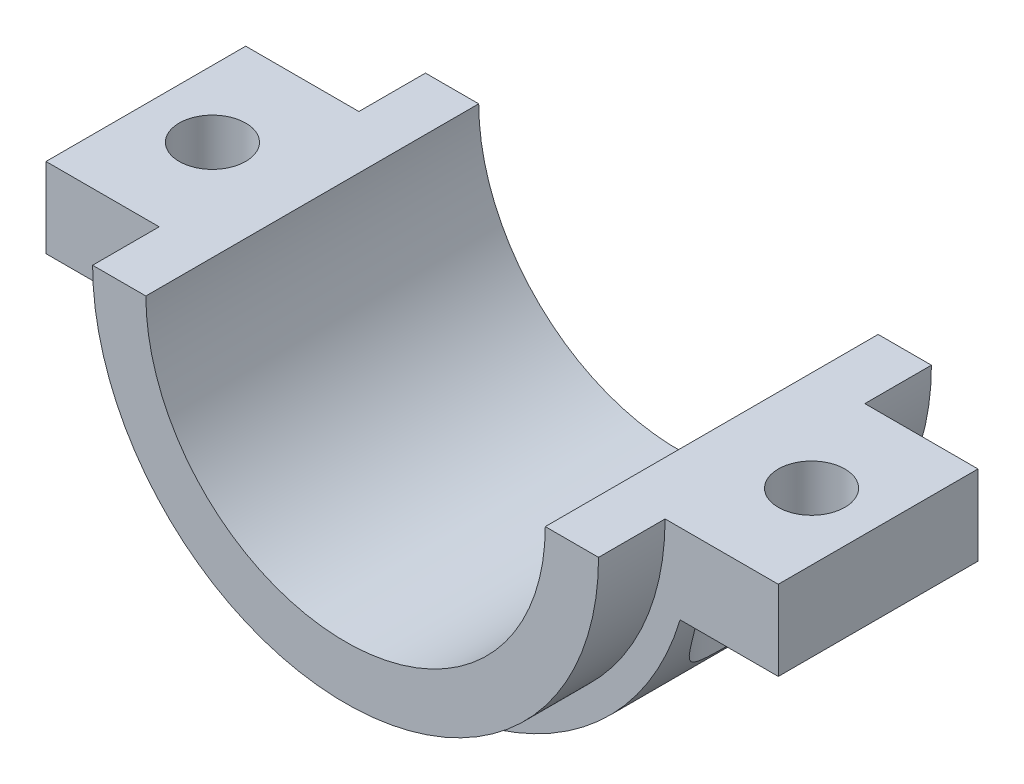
from build123d import *

# Parameters (mm, degrees)
WYCI_GNI_CIE1_DEPTH        = 15
WYCI_GNI_CIE2_DEPTH        = 25
SZKIC3_R                   = 13
WYTNIJ_WYCI_GNI_CIE1_DEPTH = 68.453687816
SZKIC4_R                   = 5
WYTNIJ_WYCI_GNI_CIE2_DEPTH = 68.453687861


with BuildPart() as part:
    # Szkic1 → Wyci_gni_cie1 (new, symmetric)
    with BuildSketch(Plane.XY):
        with BuildLine():
            Line((30, 0), (55, 0))
            Line((55, 0), (55, -12))
            Line((55, -12), (40.249223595, -12))
            ThreePointArc((40.249223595, -12), (0, -42), (-40.249223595, -12))
            Line((-40.249223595, -12), (-55, -12))
            Line((-55, -12), (-55, 0))
            Line((-55, 0), (-30, 0))
            ThreePointArc((-30, 0), (0, -30), (30, 0))
        make_face()
    extrude(amount=WYCI_GNI_CIE1_DEPTH, both=True)

    # Szkic2 → Wyci_gni_cie2 (add, symmetric)
    with BuildSketch(Plane.XY):
        with BuildLine():
            Line((-38, 0), (-30, 0))
            ThreePointArc((-30, 0), (0, -30), (30, 0))
            Line((30, 0), (38, 0))
            ThreePointArc((38, 0), (0, -38), (-38, 0))
        make_face()
    extrude(amount=WYCI_GNI_CIE2_DEPTH, both=True)

    # Szkic3 → Wytnij-wyci_gni_cie1 (cut, through all)
    with BuildSketch(Plane.XZ.offset(12)):
        with Locations((45, 0)):
            Circle(SZKIC3_R)
    wytnij_wyci_gni_cie1 = extrude(amount=WYTNIJ_WYCI_GNI_CIE1_DEPTH, mode=Mode.SUBTRACT)

    # Szkic4 → Wytnij-wyci_gni_cie2 (cut, through all)
    with BuildSketch(Plane.XZ.offset(12)):
        with Locations(Location((45, 0, 0), (0, 0, 270))):
            Circle(SZKIC4_R)
    wytnij_wyci_gni_cie2 = extrude(amount=-WYTNIJ_WYCI_GNI_CIE2_DEPTH, mode=Mode.SUBTRACT)

    # Lustro2: Wytnij-wyci_gni_cie1, Wytnij-wyci_gni_cie2 across plane
    add(wytnij_wyci_gni_cie1.mirror(Plane(origin=(0, 0, 0), x_dir=(0, 0, 1), z_dir=(1, 0, 0))), mode=Mode.SUBTRACT)
    add(wytnij_wyci_gni_cie2.mirror(Plane(origin=(0, 0, 0), x_dir=(0, 0, 1), z_dir=(1, 0, 0))), mode=Mode.SUBTRACT)


solid = part.part
